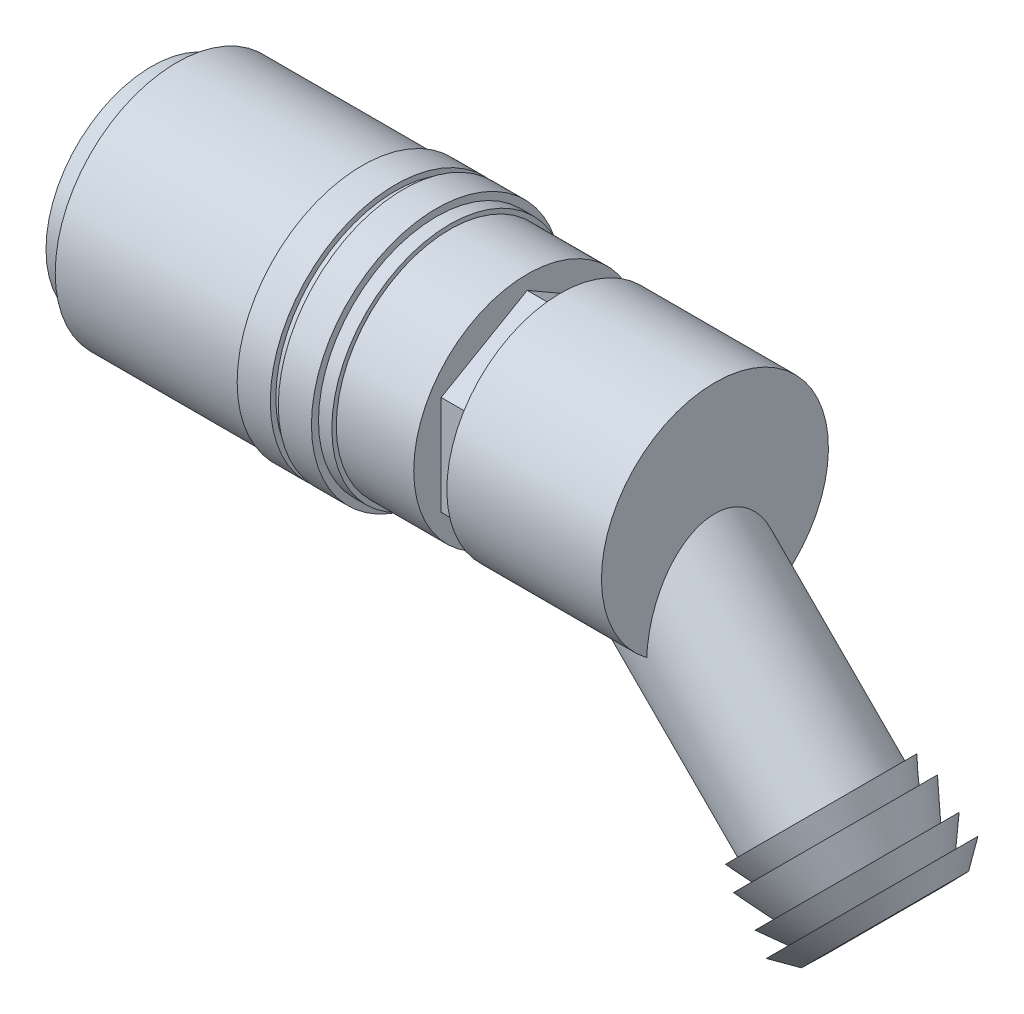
ISO-10303-21;
HEADER;
FILE_DESCRIPTION(('STEP AP214'),'2;1');
FILE_NAME('part.step','',(''),(''),'','','');
FILE_SCHEMA(('AUTOMOTIVE_DESIGN { 1 0 10303 214 1 1 1 1 }'));
ENDSEC;
DATA;
#1=APPLICATION_CONTEXT('core data for automotive mechanical design processes');
#2=APPLICATION_PROTOCOL_DEFINITION('international standard','automotive_design',2000,#1);
#3=PRODUCT_CONTEXT('',#1,'mechanical');
#4=PRODUCT('Part','Part','',(#3));
#5=PRODUCT_RELATED_PRODUCT_CATEGORY('part','',(#4));
#6=PRODUCT_DEFINITION_FORMATION('','',#4);
#7=PRODUCT_DEFINITION_CONTEXT('part definition',#1,'design');
#8=PRODUCT_DEFINITION('design','',#6,#7);
#9=PRODUCT_DEFINITION_SHAPE('','',#8);
#10=(LENGTH_UNIT() NAMED_UNIT(*) SI_UNIT(.MILLI.,.METRE.));
#11=(NAMED_UNIT(*) PLANE_ANGLE_UNIT() SI_UNIT($,.RADIAN.));
#12=(NAMED_UNIT(*) SI_UNIT($,.STERADIAN.) SOLID_ANGLE_UNIT());
#13=UNCERTAINTY_MEASURE_WITH_UNIT(LENGTH_MEASURE(1.E-05),#10,'distance_accuracy_value','');
#14=(GEOMETRIC_REPRESENTATION_CONTEXT(3) GLOBAL_UNCERTAINTY_ASSIGNED_CONTEXT((#13)) GLOBAL_UNIT_ASSIGNED_CONTEXT((#10,
#11,#12)) REPRESENTATION_CONTEXT('',''));
#15=CARTESIAN_POINT('',(0.,0.,0.));
#16=DIRECTION('',(0.,0.,1.));
#17=DIRECTION('',(1.,0.,0.));
#18=AXIS2_PLACEMENT_3D('',#15,#16,#17);
#19=CARTESIAN_POINT('',(51.,0.,0.));
#20=DIRECTION('',(-1.,0.,0.));
#21=DIRECTION('',(0.,0.,1.));
#22=AXIS2_PLACEMENT_3D('',#19,#20,#21);
#23=CYLINDRICAL_SURFACE('',#22,10.2763207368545);
#24=CARTESIAN_POINT('',(37.,0.,0.));
#25=DIRECTION('',(1.,0.,0.));
#26=DIRECTION('',(0.,0.,-1.));
#27=AXIS2_PLACEMENT_3D('',#24,#25,#26);
#28=CIRCLE('',#27,10.2763207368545);
#29=CARTESIAN_POINT('',(37.,0.,-10.2763207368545));
#30=VERTEX_POINT('',#29);
#31=EDGE_CURVE('E92',#30,#30,#28,.T.);
#32=ORIENTED_EDGE('',*,*,#31,.T.);
#33=EDGE_LOOP('',(#32));
#34=FACE_BOUND('',#33,.T.);
#35=CARTESIAN_POINT('',(51.,-8.21534723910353,6.17339757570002));
#36=CARTESIAN_POINT('',(50.8693512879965,-8.21125639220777,6.17883773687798));
#37=CARTESIAN_POINT('',(50.7385865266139,-8.20857286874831,6.18240221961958));
#38=CARTESIAN_POINT('',(50.4769371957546,-8.20624871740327,6.18548781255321));
#39=CARTESIAN_POINT('',(50.3460526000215,-8.20660919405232,6.18500745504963));
#40=CARTESIAN_POINT('',(49.9524538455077,-8.21261872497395,6.17703493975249));
#41=CARTESIAN_POINT('',(49.6898724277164,-8.22323342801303,6.16296159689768));
#42=CARTESIAN_POINT('',(49.1655951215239,-8.25948475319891,6.11429677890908));
#43=CARTESIAN_POINT('',(48.9039206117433,-8.28523334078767,6.07955234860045));
#44=CARTESIAN_POINT('',(48.3873196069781,-8.3529245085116,5.98621636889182));
#45=CARTESIAN_POINT('',(48.1323807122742,-8.39483473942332,5.92767244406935));
#46=CARTESIAN_POINT('',(47.7295574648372,-8.47538979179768,5.81148526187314));
#47=CARTESIAN_POINT('',(47.5782400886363,-8.5090813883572,5.76217027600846));
#48=CARTESIAN_POINT('',(47.2808781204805,-8.58210259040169,5.65284184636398));
#49=CARTESIAN_POINT('',(47.1348337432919,-8.62143242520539,5.59282796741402));
#50=CARTESIAN_POINT('',(46.849916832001,-8.70486442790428,5.46205824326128));
#51=CARTESIAN_POINT('',(46.7110143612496,-8.74894377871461,5.39135315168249));
#52=CARTESIAN_POINT('',(46.4407898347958,-8.84107714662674,5.23889780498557));
#53=CARTESIAN_POINT('',(46.3094676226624,-8.88913108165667,5.15714777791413));
#54=CARTESIAN_POINT('',(46.0549317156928,-8.98822340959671,4.98244136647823));
#55=CARTESIAN_POINT('',(45.9317489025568,-9.03927192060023,4.88944571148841));
#56=CARTESIAN_POINT('',(45.6948057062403,-9.14286468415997,4.69288073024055));
#57=CARTESIAN_POINT('',(45.5810455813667,-9.19540897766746,4.5893111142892));
#58=CARTESIAN_POINT('',(45.3633393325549,-9.30069155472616,4.37201337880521));
#59=CARTESIAN_POINT('',(45.2594108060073,-9.35343001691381,4.25826772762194));
#60=CARTESIAN_POINT('',(45.0619705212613,-9.45762933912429,4.02153404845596));
#61=CARTESIAN_POINT('',(44.9684587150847,-9.50909020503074,3.89854606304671));
#62=CARTESIAN_POINT('',(44.7944106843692,-9.60810034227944,3.64758608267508));
#63=CARTESIAN_POINT('',(44.7135951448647,-9.65571729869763,3.5198341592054));
#64=CARTESIAN_POINT('',(44.5620738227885,-9.747449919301,3.25719863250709));
#65=CARTESIAN_POINT('',(44.4913723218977,-9.79156409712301,3.12231204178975));
#66=CARTESIAN_POINT('',(44.3601453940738,-9.87530092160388,2.84639735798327));
#67=CARTESIAN_POINT('',(44.2996167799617,-9.914924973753,2.70537120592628));
#68=CARTESIAN_POINT('',(44.1886909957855,-9.98886898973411,2.41810977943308));
#69=CARTESIAN_POINT('',(44.1382901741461,-10.0231908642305,2.27187640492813));
#70=CARTESIAN_POINT('',(44.0451972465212,-10.0874874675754,1.967433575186));
#71=CARTESIAN_POINT('',(44.0030356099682,-10.1171474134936,1.80899515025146));
#72=CARTESIAN_POINT('',(43.9297513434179,-10.1692548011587,1.48842152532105));
#73=CARTESIAN_POINT('',(43.898629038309,-10.1917020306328,1.32628621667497));
#74=CARTESIAN_POINT('',(43.8473593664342,-10.2289328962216,0.999383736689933));
#75=CARTESIAN_POINT('',(43.8272144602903,-10.243714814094,0.834615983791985));
#76=CARTESIAN_POINT('',(43.7978690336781,-10.2653141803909,0.503592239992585));
#77=CARTESIAN_POINT('',(43.7886685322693,-10.2721316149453,0.337336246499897));
#78=CARTESIAN_POINT('',(43.7810860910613,-10.2777465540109,-0.000288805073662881));
#79=CARTESIAN_POINT('',(43.7830189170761,-10.2763107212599,-0.171668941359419));
#80=CARTESIAN_POINT('',(43.7984437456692,-10.2649025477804,-0.513625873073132));
#81=CARTESIAN_POINT('',(43.8119360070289,-10.2549300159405,-0.684202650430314));
#82=CARTESIAN_POINT('',(43.8505120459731,-10.2266543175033,-1.023361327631));
#83=CARTESIAN_POINT('',(43.8755969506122,-10.2083503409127,-1.19194303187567));
#84=CARTESIAN_POINT('',(43.9374117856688,-10.1637984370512,-1.5258917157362));
#85=CARTESIAN_POINT('',(43.9741416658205,-10.1375505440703,-1.69125870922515));
#86=CARTESIAN_POINT('',(44.0594225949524,-10.0776058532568,-2.01798967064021));
#87=CARTESIAN_POINT('',(44.108002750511,-10.0438907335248,-2.17934268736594));
#88=CARTESIAN_POINT('',(44.2170137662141,-9.96981097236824,-2.49642629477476));
#89=CARTESIAN_POINT('',(44.2774447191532,-9.92944627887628,-2.65215684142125));
#90=CARTESIAN_POINT('',(44.4102167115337,-9.84302415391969,-2.95680781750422));
#91=CARTESIAN_POINT('',(44.4825571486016,-9.79696701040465,-3.10572859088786));
#92=CARTESIAN_POINT('',(44.6391691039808,-9.70030584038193,-3.39561149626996));
#93=CARTESIAN_POINT('',(44.7234403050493,-9.64970193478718,-3.53657383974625));
#94=CARTESIAN_POINT('',(44.901845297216,-9.5464379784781,-3.80640200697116));
#95=CARTESIAN_POINT('',(44.9957188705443,-9.49384843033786,-3.93546678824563));
#96=CARTESIAN_POINT('',(45.1946191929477,-9.38699082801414,-4.18395316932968));
#97=CARTESIAN_POINT('',(45.299645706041,-9.33272280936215,-4.30337497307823));
#98=CARTESIAN_POINT('',(45.5203960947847,-9.22405096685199,-4.5316246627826));
#99=CARTESIAN_POINT('',(45.6361116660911,-9.16964727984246,-4.64046064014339));
#100=CARTESIAN_POINT('',(45.8777099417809,-9.0622010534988,-4.84694036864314));
#101=CARTESIAN_POINT('',(46.0035921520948,-9.00915844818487,-4.94458466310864));
#102=CARTESIAN_POINT('',(46.2578493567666,-8.90861591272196,-5.12340733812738));
#103=CARTESIAN_POINT('',(46.3857501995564,-8.8609711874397,-5.20517958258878));
#104=CARTESIAN_POINT('',(46.6490056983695,-8.7693675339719,-5.35806935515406));
#105=CARTESIAN_POINT('',(46.7843599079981,-8.72540838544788,-5.42918752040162));
#106=CARTESIAN_POINT('',(47.0615048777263,-8.64209548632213,-5.56084800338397));
#107=CARTESIAN_POINT('',(47.2032970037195,-8.60274271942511,-5.62138806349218));
#108=CARTESIAN_POINT('',(47.4921826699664,-8.52932375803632,-5.73217392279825));
#109=CARTESIAN_POINT('',(47.6392772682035,-8.49525862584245,-5.78241765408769));
#110=CARTESIAN_POINT('',(47.9788779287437,-8.42421121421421,-5.88560944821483));
#111=CARTESIAN_POINT('',(48.1727019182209,-8.38902343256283,-5.93546915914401));
#112=CARTESIAN_POINT('',(48.5650261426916,-8.32821805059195,-6.02048788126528));
#113=CARTESIAN_POINT('',(48.7635280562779,-8.30260394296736,-6.05564152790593));
#114=CARTESIAN_POINT('',(49.1636795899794,-8.26065550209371,-6.1127399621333));
#115=CARTESIAN_POINT('',(49.3653338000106,-8.24433631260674,-6.13466319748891));
#116=CARTESIAN_POINT('',(49.7700043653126,-8.22043913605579,-6.16664734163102));
#117=CARTESIAN_POINT('',(49.9730203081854,-8.21285861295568,-6.17671169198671));
#118=CARTESIAN_POINT('',(50.313796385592,-8.2068074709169,-6.18474645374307));
#119=CARTESIAN_POINT('',(50.4514690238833,-8.20618620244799,-6.18557190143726));
#120=CARTESIAN_POINT('',(50.7261416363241,-8.20832019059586,-6.18273645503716));
#121=CARTESIAN_POINT('',(50.8631419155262,-8.21106066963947,-6.17909519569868));
#122=CARTESIAN_POINT('',(51.,-8.21534723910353,-6.17339757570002));
#123=B_SPLINE_CURVE_WITH_KNOTS('',3,(#35,#36,#37,#38,#39,#40,#41,#42,#43,#44,#45,#46,#47,#48,
#49,#50,#51,#52,#53,#54,#55,#56,#57,#58,#59,#60,#61,#62,#63,#64,#65,#66,#67,#68,#69,#70,#71,#72,
#73,#74,#75,#76,#77,#78,#79,#80,#81,#82,#83,#84,#85,#86,#87,#88,#89,#90,#91,#92,#93,#94,#95,#96,
#97,#98,#99,#100,#101,#102,#103,#104,#105,#106,#107,#108,#109,#110,#111,#112,#113,#114,#115,
#116,#117,#118,#119,#120,#121,#122),.UNSPECIFIED.,.F.,.F.,(4,2,2,2,2,2,2,2,2,2,2,2,2,2,2,2,2,2,
2,2,2,2,2,2,2,2,2,2,2,2,2,2,2,2,2,2,2,2,2,2,2,2,2,4),(0.,0.392436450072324,0.785015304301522,
1.57340227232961,2.3676967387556,3.16040952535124,3.64797534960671,4.13556100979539,
4.62090072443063,5.10623041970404,5.59330671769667,6.08039636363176,6.56834196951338,
7.05628532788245,7.53122927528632,8.00637369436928,8.48136897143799,8.95619268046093,
9.45546226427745,9.95474654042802,10.4541426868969,10.9535397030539,11.4671239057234,
11.980719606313,12.4943652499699,13.0080086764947,13.5229266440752,14.0378486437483,
14.5527446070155,15.0676268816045,15.5710887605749,16.0745399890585,16.5776033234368,
17.0806422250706,17.5573897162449,18.0341086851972,18.5109292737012,18.9878455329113,
19.5965312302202,20.2054387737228,20.8153355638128,21.4250553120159,21.8379775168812,
22.2490910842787),.UNSPECIFIED.);
#124=CARTESIAN_POINT('',(51.,-8.21534723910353,6.17339757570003));
#125=VERTEX_POINT('',#124);
#126=CARTESIAN_POINT('',(51.,-8.21534723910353,-6.17339757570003));
#127=VERTEX_POINT('',#126);
#128=EDGE_CURVE('E81',#125,#127,#123,.T.);
#129=ORIENTED_EDGE('',*,*,#128,.F.);
#130=CARTESIAN_POINT('',(51.,0.,0.));
#131=DIRECTION('',(1.,0.,0.));
#132=DIRECTION('',(0.,0.,-1.));
#133=AXIS2_PLACEMENT_3D('',#130,#131,#132);
#134=CIRCLE('',#133,10.2763207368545);
#135=EDGE_CURVE('E87',#127,#125,#134,.T.);
#136=ORIENTED_EDGE('',*,*,#135,.F.);
#137=EDGE_LOOP('',(#129,#136));
#138=FACE_BOUND('',#137,.T.);
#139=ADVANCED_FACE('F16',(#34,#138),#23,.T.);
#140=CARTESIAN_POINT('',(34.,6.8,0.));
#141=DIRECTION('',(-1.,0.,0.));
#142=DIRECTION('',(0.,0.,1.));
#143=AXIS2_PLACEMENT_3D('',#140,#141,#142);
#144=PLANE('',#143);
#145=CARTESIAN_POINT('',(34.,0.,0.));
#146=DIRECTION('',(-1.,0.,0.));
#147=DIRECTION('',(0.,0.,1.));
#148=AXIS2_PLACEMENT_3D('',#145,#146,#147);
#149=CIRCLE('',#148,10.2763207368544);
#150=CARTESIAN_POINT('',(34.,0.,10.2763207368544));
#151=VERTEX_POINT('',#150);
#152=EDGE_CURVE('E198',#151,#151,#149,.T.);
#153=ORIENTED_EDGE('',*,*,#152,.F.);
#154=EDGE_LOOP('',(#153));
#155=FACE_BOUND('',#154,.T.);
#156=DIRECTION('',(0.,0.5,0.866025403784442));
#157=VECTOR('',#156,1.);
#158=CARTESIAN_POINT('',(34.,4.50000000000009,-7.7942286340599));
#159=LINE('',#158,#157);
#160=CARTESIAN_POINT('',(34.,4.50000000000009,-7.7942286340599));
#161=VERTEX_POINT('',#160);
#162=CARTESIAN_POINT('',(34.,9.,0.));
#163=VERTEX_POINT('',#162);
#164=EDGE_CURVE('E111',#161,#163,#159,.T.);
#165=ORIENTED_EDGE('',*,*,#164,.F.);
#166=DIRECTION('',(0.,1.,0.));
#167=VECTOR('',#166,1.);
#168=CARTESIAN_POINT('',(34.,-4.49999999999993,-7.79422863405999));
#169=LINE('',#168,#167);
#170=CARTESIAN_POINT('',(34.,-4.49999999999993,-7.79422863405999));
#171=VERTEX_POINT('',#170);
#172=EDGE_CURVE('E116',#171,#161,#169,.T.);
#173=ORIENTED_EDGE('',*,*,#172,.F.);
#174=DIRECTION('',(0.,0.500000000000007,-0.866025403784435));
#175=VECTOR('',#174,1.);
#176=CARTESIAN_POINT('',(34.,-9.,0.));
#177=LINE('',#176,#175);
#178=CARTESIAN_POINT('',(34.,-9.,0.));
#179=VERTEX_POINT('',#178);
#180=EDGE_CURVE('E141',#179,#171,#177,.T.);
#181=ORIENTED_EDGE('',*,*,#180,.F.);
#182=DIRECTION('',(0.,-0.5,-0.866025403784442));
#183=VECTOR('',#182,1.);
#184=CARTESIAN_POINT('',(34.,-4.5,7.79422863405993));
#185=LINE('',#184,#183);
#186=CARTESIAN_POINT('',(34.,-4.5,7.79422863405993));
#187=VERTEX_POINT('',#186);
#188=EDGE_CURVE('E138',#187,#179,#185,.T.);
#189=ORIENTED_EDGE('',*,*,#188,.F.);
#190=DIRECTION('',(0.,-1.,0.));
#191=VECTOR('',#190,1.);
#192=CARTESIAN_POINT('',(34.,4.5,7.79422863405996));
#193=LINE('',#192,#191);
#194=CARTESIAN_POINT('',(34.,4.5,7.79422863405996));
#195=VERTEX_POINT('',#194);
#196=EDGE_CURVE('E135',#195,#187,#193,.T.);
#197=ORIENTED_EDGE('',*,*,#196,.F.);
#198=DIRECTION('',(0.,-0.5,0.866025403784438));
#199=VECTOR('',#198,1.);
#200=CARTESIAN_POINT('',(34.,9.,0.));
#201=LINE('',#200,#199);
#202=EDGE_CURVE('E37',#163,#195,#201,.T.);
#203=ORIENTED_EDGE('',*,*,#202,.F.);
#204=EDGE_LOOP('',(#165,#173,#181,#189,#197,#203));
#205=FACE_BOUND('',#204,.T.);
#206=ADVANCED_FACE('F214',(#155,#205),#144,.F.);
#207=CARTESIAN_POINT('',(0.,0.,0.));
#208=DIRECTION('',(-1.,0.,0.));
#209=DIRECTION('',(0.,0.,1.));
#210=AXIS2_PLACEMENT_3D('',#207,#208,#209);
#211=CYLINDRICAL_SURFACE('',#210,9.57299306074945);
#212=CARTESIAN_POINT('',(0.,0.,0.));
#213=DIRECTION('',(-1.,0.,0.));
#214=DIRECTION('',(0.,0.,1.));
#215=AXIS2_PLACEMENT_3D('',#212,#213,#214);
#216=CIRCLE('',#215,9.57299306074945);
#217=CARTESIAN_POINT('',(0.,0.,9.57299306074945));
#218=VERTEX_POINT('',#217);
#219=EDGE_CURVE('E85',#218,#218,#216,.T.);
#220=ORIENTED_EDGE('',*,*,#219,.F.);
#221=EDGE_LOOP('',(#220));
#222=FACE_BOUND('',#221,.T.);
#223=CARTESIAN_POINT('',(2.26082941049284,0.,0.));
#224=DIRECTION('',(-1.,0.,0.));
#225=DIRECTION('',(0.,0.,1.));
#226=AXIS2_PLACEMENT_3D('',#223,#224,#225);
#227=CIRCLE('',#226,9.57299306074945);
#228=CARTESIAN_POINT('',(2.26082941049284,0.,9.57299306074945));
#229=VERTEX_POINT('',#228);
#230=EDGE_CURVE('E162',#229,#229,#227,.T.);
#231=ORIENTED_EDGE('',*,*,#230,.T.);
#232=EDGE_LOOP('',(#231));
#233=FACE_BOUND('',#232,.T.);
#234=ADVANCED_FACE('F18',(#222,#233),#211,.T.);
#235=CARTESIAN_POINT('',(0.,6.8,0.));
#236=DIRECTION('',(1.,0.,0.));
#237=DIRECTION('',(0.,0.,-1.));
#238=AXIS2_PLACEMENT_3D('',#235,#236,#237);
#239=PLANE('',#238);
#240=CARTESIAN_POINT('',(0.,0.,0.));
#241=DIRECTION('',(-1.,0.,0.));
#242=DIRECTION('',(0.,0.,1.));
#243=AXIS2_PLACEMENT_3D('',#240,#241,#242);
#244=CIRCLE('',#243,6.8);
#245=CARTESIAN_POINT('',(0.,0.,6.8));
#246=VERTEX_POINT('',#245);
#247=EDGE_CURVE('E204',#246,#246,#244,.T.);
#248=ORIENTED_EDGE('',*,*,#247,.F.);
#249=EDGE_LOOP('',(#248));
#250=FACE_BOUND('',#249,.T.);
#251=ORIENTED_EDGE('',*,*,#219,.T.);
#252=EDGE_LOOP('',(#251));
#253=FACE_BOUND('',#252,.T.);
#254=ADVANCED_FACE('F210',(#250,#253),#239,.F.);
#255=CARTESIAN_POINT('',(0.,0.,0.));
#256=DIRECTION('',(-1.,0.,0.));
#257=DIRECTION('',(0.,0.,1.));
#258=AXIS2_PLACEMENT_3D('',#255,#256,#257);
#259=CYLINDRICAL_SURFACE('',#258,6.8);
#260=CARTESIAN_POINT('',(34.,0.,0.));
#261=DIRECTION('',(-1.,0.,0.));
#262=DIRECTION('',(0.,0.,1.));
#263=AXIS2_PLACEMENT_3D('',#260,#261,#262);
#264=CIRCLE('',#263,6.8);
#265=CARTESIAN_POINT('',(34.,0.,6.8));
#266=VERTEX_POINT('',#265);
#267=EDGE_CURVE('E201',#266,#266,#264,.T.);
#268=ORIENTED_EDGE('',*,*,#267,.F.);
#269=EDGE_LOOP('',(#268));
#270=FACE_BOUND('',#269,.T.);
#271=ORIENTED_EDGE('',*,*,#247,.T.);
#272=EDGE_LOOP('',(#271));
#273=FACE_BOUND('',#272,.T.);
#274=ADVANCED_FACE('F287',(#270,#273),#259,.F.);
#275=CARTESIAN_POINT('',(0.,0.,0.));
#276=DIRECTION('',(-1.,0.,0.));
#277=DIRECTION('',(0.,0.,1.));
#278=AXIS2_PLACEMENT_3D('',#275,#276,#277);
#279=CYLINDRICAL_SURFACE('',#278,10.2763207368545);
#280=CARTESIAN_POINT('',(26.9893792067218,0.,0.));
#281=DIRECTION('',(-1.,0.,0.));
#282=DIRECTION('',(0.,0.,1.));
#283=AXIS2_PLACEMENT_3D('',#280,#281,#282);
#284=CIRCLE('',#283,10.2763207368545);
#285=CARTESIAN_POINT('',(26.9893792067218,0.,10.2763207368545));
#286=VERTEX_POINT('',#285);
#287=EDGE_CURVE('E195',#286,#286,#284,.T.);
#288=ORIENTED_EDGE('',*,*,#287,.F.);
#289=EDGE_LOOP('',(#288));
#290=FACE_BOUND('',#289,.T.);
#291=ORIENTED_EDGE('',*,*,#152,.T.);
#292=EDGE_LOOP('',(#291));
#293=FACE_BOUND('',#292,.T.);
#294=ADVANCED_FACE('F281',(#290,#293),#279,.T.);
#295=CARTESIAN_POINT('',(26.9893792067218,10.6817722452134,0.));
#296=DIRECTION('',(-1.,0.,0.));
#297=DIRECTION('',(0.,0.,1.));
#298=AXIS2_PLACEMENT_3D('',#295,#296,#297);
#299=PLANE('',#298);
#300=CARTESIAN_POINT('',(26.9893792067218,0.,0.));
#301=DIRECTION('',(-1.,0.,0.));
#302=DIRECTION('',(0.,0.,1.));
#303=AXIS2_PLACEMENT_3D('',#300,#301,#302);
#304=CIRCLE('',#303,10.6817722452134);
#305=CARTESIAN_POINT('',(26.9893792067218,0.,10.6817722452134));
#306=VERTEX_POINT('',#305);
#307=EDGE_CURVE('E192',#306,#306,#304,.T.);
#308=ORIENTED_EDGE('',*,*,#307,.F.);
#309=EDGE_LOOP('',(#308));
#310=FACE_BOUND('',#309,.T.);
#311=ORIENTED_EDGE('',*,*,#287,.T.);
#312=EDGE_LOOP('',(#311));
#313=FACE_BOUND('',#312,.T.);
#314=ADVANCED_FACE('F275',(#310,#313),#299,.F.);
#315=CARTESIAN_POINT('',(0.,0.,0.));
#316=DIRECTION('',(-1.,0.,0.));
#317=DIRECTION('',(0.,0.,1.));
#318=AXIS2_PLACEMENT_3D('',#315,#316,#317);
#319=CYLINDRICAL_SURFACE('',#318,10.6817722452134);
#320=CARTESIAN_POINT('',(25.7841800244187,0.,0.));
#321=DIRECTION('',(-1.,0.,0.));
#322=DIRECTION('',(0.,0.,1.));
#323=AXIS2_PLACEMENT_3D('',#320,#321,#322);
#324=CIRCLE('',#323,10.6817722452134);
#325=CARTESIAN_POINT('',(25.7841800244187,0.,10.6817722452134));
#326=VERTEX_POINT('',#325);
#327=EDGE_CURVE('E189',#326,#326,#324,.T.);
#328=ORIENTED_EDGE('',*,*,#327,.F.);
#329=EDGE_LOOP('',(#328));
#330=FACE_BOUND('',#329,.T.);
#331=ORIENTED_EDGE('',*,*,#307,.T.);
#332=EDGE_LOOP('',(#331));
#333=FACE_BOUND('',#332,.T.);
#334=ADVANCED_FACE('F269',(#330,#333),#319,.T.);
#335=CARTESIAN_POINT('',(25.7841800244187,11.3216876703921,0.));
#336=DIRECTION('',(-1.,0.,0.));
#337=DIRECTION('',(0.,0.,1.));
#338=AXIS2_PLACEMENT_3D('',#335,#336,#337);
#339=PLANE('',#338);
#340=CARTESIAN_POINT('',(25.7841800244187,0.,0.));
#341=DIRECTION('',(-1.,0.,0.));
#342=DIRECTION('',(0.,0.,1.));
#343=AXIS2_PLACEMENT_3D('',#340,#341,#342);
#344=CIRCLE('',#343,11.3216876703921);
#345=CARTESIAN_POINT('',(25.7841800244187,0.,11.3216876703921));
#346=VERTEX_POINT('',#345);
#347=EDGE_CURVE('E186',#346,#346,#344,.T.);
#348=ORIENTED_EDGE('',*,*,#347,.F.);
#349=EDGE_LOOP('',(#348));
#350=FACE_BOUND('',#349,.T.);
#351=ORIENTED_EDGE('',*,*,#327,.T.);
#352=EDGE_LOOP('',(#351));
#353=FACE_BOUND('',#352,.T.);
#354=ADVANCED_FACE('F263',(#350,#353),#339,.F.);
#355=CARTESIAN_POINT('',(0.,0.,0.));
#356=DIRECTION('',(-1.,0.,0.));
#357=DIRECTION('',(0.,0.,1.));
#358=AXIS2_PLACEMENT_3D('',#355,#356,#357);
#359=CYLINDRICAL_SURFACE('',#358,11.3216876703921);
#360=CARTESIAN_POINT('',(22.7841800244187,0.,0.));
#361=DIRECTION('',(-1.,0.,0.));
#362=DIRECTION('',(0.,0.,1.));
#363=AXIS2_PLACEMENT_3D('',#360,#361,#362);
#364=CIRCLE('',#363,11.3216876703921);
#365=CARTESIAN_POINT('',(22.7841800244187,0.,11.3216876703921));
#366=VERTEX_POINT('',#365);
#367=EDGE_CURVE('E183',#366,#366,#364,.T.);
#368=ORIENTED_EDGE('',*,*,#367,.F.);
#369=EDGE_LOOP('',(#368));
#370=FACE_BOUND('',#369,.T.);
#371=ORIENTED_EDGE('',*,*,#347,.T.);
#372=EDGE_LOOP('',(#371));
#373=FACE_BOUND('',#372,.T.);
#374=ADVANCED_FACE('F257',(#370,#373),#359,.T.);
#375=CARTESIAN_POINT('',(22.7841800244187,10.8216876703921,0.));
#376=DIRECTION('',(1.,0.,0.));
#377=DIRECTION('',(0.,0.,-1.));
#378=AXIS2_PLACEMENT_3D('',#375,#376,#377);
#379=PLANE('',#378);
#380=CARTESIAN_POINT('',(22.7841800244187,0.,0.));
#381=DIRECTION('',(-1.,0.,0.));
#382=DIRECTION('',(0.,0.,1.));
#383=AXIS2_PLACEMENT_3D('',#380,#381,#382);
#384=CIRCLE('',#383,10.8216876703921);
#385=CARTESIAN_POINT('',(22.7841800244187,0.,10.8216876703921));
#386=VERTEX_POINT('',#385);
#387=EDGE_CURVE('E180',#386,#386,#384,.T.);
#388=ORIENTED_EDGE('',*,*,#387,.F.);
#389=EDGE_LOOP('',(#388));
#390=FACE_BOUND('',#389,.T.);
#391=ORIENTED_EDGE('',*,*,#367,.T.);
#392=EDGE_LOOP('',(#391));
#393=FACE_BOUND('',#392,.T.);
#394=ADVANCED_FACE('F251',(#390,#393),#379,.F.);
#395=CARTESIAN_POINT('',(0.,0.,0.));
#396=DIRECTION('',(-1.,0.,0.));
#397=DIRECTION('',(0.,0.,1.));
#398=AXIS2_PLACEMENT_3D('',#395,#396,#397);
#399=CYLINDRICAL_SURFACE('',#398,10.8216876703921);
#400=CARTESIAN_POINT('',(22.0582244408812,0.,0.));
#401=DIRECTION('',(-1.,0.,0.));
#402=DIRECTION('',(0.,0.,1.));
#403=AXIS2_PLACEMENT_3D('',#400,#401,#402);
#404=CIRCLE('',#403,10.8216876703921);
#405=CARTESIAN_POINT('',(22.0582244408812,0.,10.8216876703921));
#406=VERTEX_POINT('',#405);
#407=EDGE_CURVE('E177',#406,#406,#404,.T.);
#408=ORIENTED_EDGE('',*,*,#407,.F.);
#409=EDGE_LOOP('',(#408));
#410=FACE_BOUND('',#409,.T.);
#411=ORIENTED_EDGE('',*,*,#387,.T.);
#412=EDGE_LOOP('',(#411));
#413=FACE_BOUND('',#412,.T.);
#414=ADVANCED_FACE('F245',(#410,#413),#399,.T.);
#415=CARTESIAN_POINT('',(22.0582244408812,11.3216876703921,0.));
#416=DIRECTION('',(-1.,0.,0.));
#417=DIRECTION('',(0.,0.,1.));
#418=AXIS2_PLACEMENT_3D('',#415,#416,#417);
#419=PLANE('',#418);
#420=CARTESIAN_POINT('',(22.0582244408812,0.,0.));
#421=DIRECTION('',(-1.,0.,0.));
#422=DIRECTION('',(0.,0.,1.));
#423=AXIS2_PLACEMENT_3D('',#420,#421,#422);
#424=CIRCLE('',#423,11.3216876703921);
#425=CARTESIAN_POINT('',(22.0582244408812,0.,11.3216876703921));
#426=VERTEX_POINT('',#425);
#427=EDGE_CURVE('E174',#426,#426,#424,.T.);
#428=ORIENTED_EDGE('',*,*,#427,.F.);
#429=EDGE_LOOP('',(#428));
#430=FACE_BOUND('',#429,.T.);
#431=ORIENTED_EDGE('',*,*,#407,.T.);
#432=EDGE_LOOP('',(#431));
#433=FACE_BOUND('',#432,.T.);
#434=ADVANCED_FACE('F239',(#430,#433),#419,.F.);
#435=CARTESIAN_POINT('',(0.,0.,0.));
#436=DIRECTION('',(-1.,0.,0.));
#437=DIRECTION('',(0.,0.,1.));
#438=AXIS2_PLACEMENT_3D('',#435,#436,#437);
#439=CYLINDRICAL_SURFACE('',#438,11.3216876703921);
#440=CARTESIAN_POINT('',(19.0582244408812,0.,0.));
#441=DIRECTION('',(-1.,0.,0.));
#442=DIRECTION('',(0.,0.,1.));
#443=AXIS2_PLACEMENT_3D('',#440,#441,#442);
#444=CIRCLE('',#443,11.3216876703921);
#445=CARTESIAN_POINT('',(19.0582244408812,0.,11.3216876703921));
#446=VERTEX_POINT('',#445);
#447=EDGE_CURVE('E171',#446,#446,#444,.T.);
#448=ORIENTED_EDGE('',*,*,#447,.F.);
#449=EDGE_LOOP('',(#448));
#450=FACE_BOUND('',#449,.T.);
#451=ORIENTED_EDGE('',*,*,#427,.T.);
#452=EDGE_LOOP('',(#451));
#453=FACE_BOUND('',#452,.T.);
#454=ADVANCED_FACE('F233',(#450,#453),#439,.T.);
#455=CARTESIAN_POINT('',(19.0582244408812,11.,0.));
#456=DIRECTION('',(1.,0.,0.));
#457=DIRECTION('',(0.,0.,-1.));
#458=AXIS2_PLACEMENT_3D('',#455,#456,#457);
#459=PLANE('',#458);
#460=CARTESIAN_POINT('',(19.0582244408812,0.,0.));
#461=DIRECTION('',(-1.,0.,0.));
#462=DIRECTION('',(0.,0.,1.));
#463=AXIS2_PLACEMENT_3D('',#460,#461,#462);
#464=CIRCLE('',#463,11.);
#465=CARTESIAN_POINT('',(19.0582244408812,0.,11.));
#466=VERTEX_POINT('',#465);
#467=EDGE_CURVE('E168',#466,#466,#464,.T.);
#468=ORIENTED_EDGE('',*,*,#467,.F.);
#469=EDGE_LOOP('',(#468));
#470=FACE_BOUND('',#469,.T.);
#471=ORIENTED_EDGE('',*,*,#447,.T.);
#472=EDGE_LOOP('',(#471));
#473=FACE_BOUND('',#472,.T.);
#474=ADVANCED_FACE('F227',(#470,#473),#459,.F.);
#475=CARTESIAN_POINT('',(0.,0.,0.));
#476=DIRECTION('',(-1.,0.,0.));
#477=DIRECTION('',(0.,0.,1.));
#478=AXIS2_PLACEMENT_3D('',#475,#476,#477);
#479=CYLINDRICAL_SURFACE('',#478,11.);
#480=CARTESIAN_POINT('',(2.26082941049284,0.,0.));
#481=DIRECTION('',(-1.,0.,0.));
#482=DIRECTION('',(0.,0.,1.));
#483=AXIS2_PLACEMENT_3D('',#480,#481,#482);
#484=CIRCLE('',#483,11.);
#485=CARTESIAN_POINT('',(2.26082941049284,0.,11.));
#486=VERTEX_POINT('',#485);
#487=EDGE_CURVE('E165',#486,#486,#484,.T.);
#488=ORIENTED_EDGE('',*,*,#487,.F.);
#489=EDGE_LOOP('',(#488));
#490=FACE_BOUND('',#489,.T.);
#491=ORIENTED_EDGE('',*,*,#467,.T.);
#492=EDGE_LOOP('',(#491));
#493=FACE_BOUND('',#492,.T.);
#494=ADVANCED_FACE('F221',(#490,#493),#479,.T.);
#495=CARTESIAN_POINT('',(2.26082941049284,9.57299306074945,0.));
#496=DIRECTION('',(1.,0.,0.));
#497=DIRECTION('',(0.,0.,-1.));
#498=AXIS2_PLACEMENT_3D('',#495,#496,#497);
#499=PLANE('',#498);
#500=ORIENTED_EDGE('',*,*,#230,.F.);
#501=EDGE_LOOP('',(#500));
#502=FACE_BOUND('',#501,.T.);
#503=ORIENTED_EDGE('',*,*,#487,.T.);
#504=EDGE_LOOP('',(#503));
#505=FACE_BOUND('',#504,.T.);
#506=ADVANCED_FACE('F217',(#502,#505),#499,.F.);
#507=CARTESIAN_POINT('',(34.,0.,0.));
#508=DIRECTION('',(1.,0.,0.));
#509=DIRECTION('',(0.,0.,-1.));
#510=AXIS2_PLACEMENT_3D('',#507,#508,#509);
#511=PLANE('',#510);
#512=CARTESIAN_POINT('',(34.,0.,0.));
#513=DIRECTION('',(1.,0.,0.));
#514=DIRECTION('',(0.,0.,-1.));
#515=AXIS2_PLACEMENT_3D('',#512,#513,#514);
#516=CIRCLE('',#515,4.75);
#517=CARTESIAN_POINT('',(34.,0.,-4.75));
#518=VERTEX_POINT('',#517);
#519=EDGE_CURVE('E108',#518,#518,#516,.T.);
#520=ORIENTED_EDGE('',*,*,#519,.T.);
#521=EDGE_LOOP('',(#520));
#522=FACE_BOUND('',#521,.T.);
#523=ORIENTED_EDGE('',*,*,#267,.T.);
#524=EDGE_LOOP('',(#523));
#525=FACE_BOUND('',#524,.T.);
#526=ADVANCED_FACE('F220',(#522,#525),#511,.F.);
#527=CARTESIAN_POINT('',(37.,4.50000000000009,-7.7942286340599));
#528=DIRECTION('',(0.,-0.866025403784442,0.5));
#529=DIRECTION('',(0.,-0.5,-0.866025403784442));
#530=AXIS2_PLACEMENT_3D('',#527,#528,#529);
#531=PLANE('',#530);
#532=ORIENTED_EDGE('',*,*,#164,.T.);
#533=DIRECTION('',(-1.,0.,0.));
#534=VECTOR('',#533,1.);
#535=CARTESIAN_POINT('',(37.,9.,0.));
#536=LINE('',#535,#534);
#537=CARTESIAN_POINT('',(37.,9.,0.));
#538=VERTEX_POINT('',#537);
#539=EDGE_CURVE('E160',#538,#163,#536,.T.);
#540=ORIENTED_EDGE('',*,*,#539,.F.);
#541=DIRECTION('',(0.,0.5,0.866025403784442));
#542=VECTOR('',#541,1.);
#543=CARTESIAN_POINT('',(37.,4.50000000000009,-7.7942286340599));
#544=LINE('',#543,#542);
#545=CARTESIAN_POINT('',(37.,4.50000000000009,-7.7942286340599));
#546=VERTEX_POINT('',#545);
#547=EDGE_CURVE('E112',#546,#538,#544,.T.);
#548=ORIENTED_EDGE('',*,*,#547,.F.);
#549=DIRECTION('',(-1.,0.,0.));
#550=VECTOR('',#549,1.);
#551=CARTESIAN_POINT('',(37.,4.50000000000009,-7.7942286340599));
#552=LINE('',#551,#550);
#553=EDGE_CURVE('E131',#546,#161,#552,.T.);
#554=ORIENTED_EDGE('',*,*,#553,.T.);
#555=EDGE_LOOP('',(#532,#540,#548,#554));
#556=FACE_BOUND('',#555,.T.);
#557=ADVANCED_FACE('F299',(#556),#531,.F.);
#558=CARTESIAN_POINT('',(37.,9.,0.));
#559=DIRECTION('',(0.,-0.866025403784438,-0.5));
#560=DIRECTION('',(0.,0.5,-0.866025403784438));
#561=AXIS2_PLACEMENT_3D('',#558,#559,#560);
#562=PLANE('',#561);
#563=ORIENTED_EDGE('',*,*,#202,.T.);
#564=DIRECTION('',(-1.,0.,0.));
#565=VECTOR('',#564,1.);
#566=CARTESIAN_POINT('',(37.,4.5,7.79422863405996));
#567=LINE('',#566,#565);
#568=CARTESIAN_POINT('',(37.,4.5,7.79422863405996));
#569=VERTEX_POINT('',#568);
#570=EDGE_CURVE('E157',#569,#195,#567,.T.);
#571=ORIENTED_EDGE('',*,*,#570,.F.);
#572=DIRECTION('',(0.,-0.5,0.866025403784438));
#573=VECTOR('',#572,1.);
#574=CARTESIAN_POINT('',(37.,9.,0.));
#575=LINE('',#574,#573);
#576=EDGE_CURVE('E115',#538,#569,#575,.T.);
#577=ORIENTED_EDGE('',*,*,#576,.F.);
#578=ORIENTED_EDGE('',*,*,#539,.T.);
#579=EDGE_LOOP('',(#563,#571,#577,#578));
#580=FACE_BOUND('',#579,.T.);
#581=ADVANCED_FACE('F313',(#580),#562,.F.);
#582=CARTESIAN_POINT('',(37.,4.5,7.79422863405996));
#583=DIRECTION('',(0.,0.,-1.));
#584=DIRECTION('',(0.,1.,0.));
#585=AXIS2_PLACEMENT_3D('',#582,#583,#584);
#586=PLANE('',#585);
#587=ORIENTED_EDGE('',*,*,#196,.T.);
#588=DIRECTION('',(-1.,0.,0.));
#589=VECTOR('',#588,1.);
#590=CARTESIAN_POINT('',(37.,-4.5,7.79422863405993));
#591=LINE('',#590,#589);
#592=CARTESIAN_POINT('',(37.,-4.5,7.79422863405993));
#593=VERTEX_POINT('',#592);
#594=EDGE_CURVE('E154',#593,#187,#591,.T.);
#595=ORIENTED_EDGE('',*,*,#594,.F.);
#596=DIRECTION('',(0.,-1.,0.));
#597=VECTOR('',#596,1.);
#598=CARTESIAN_POINT('',(37.,4.5,7.79422863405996));
#599=LINE('',#598,#597);
#600=EDGE_CURVE('E119',#569,#593,#599,.T.);
#601=ORIENTED_EDGE('',*,*,#600,.F.);
#602=ORIENTED_EDGE('',*,*,#570,.T.);
#603=EDGE_LOOP('',(#587,#595,#601,#602));
#604=FACE_BOUND('',#603,.T.);
#605=ADVANCED_FACE('F311',(#604),#586,.F.);
#606=CARTESIAN_POINT('',(37.,-4.5,7.79422863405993));
#607=DIRECTION('',(0.,0.866025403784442,-0.5));
#608=DIRECTION('',(0.,0.5,0.866025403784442));
#609=AXIS2_PLACEMENT_3D('',#606,#607,#608);
#610=PLANE('',#609);
#611=ORIENTED_EDGE('',*,*,#188,.T.);
#612=DIRECTION('',(-1.,0.,0.));
#613=VECTOR('',#612,1.);
#614=CARTESIAN_POINT('',(37.,-9.,0.));
#615=LINE('',#614,#613);
#616=CARTESIAN_POINT('',(37.,-9.,0.));
#617=VERTEX_POINT('',#616);
#618=EDGE_CURVE('E151',#617,#179,#615,.T.);
#619=ORIENTED_EDGE('',*,*,#618,.F.);
#620=DIRECTION('',(0.,-0.5,-0.866025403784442));
#621=VECTOR('',#620,1.);
#622=CARTESIAN_POINT('',(37.,-4.5,7.79422863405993));
#623=LINE('',#622,#621);
#624=EDGE_CURVE('E122',#593,#617,#623,.T.);
#625=ORIENTED_EDGE('',*,*,#624,.F.);
#626=ORIENTED_EDGE('',*,*,#594,.T.);
#627=EDGE_LOOP('',(#611,#619,#625,#626));
#628=FACE_BOUND('',#627,.T.);
#629=ADVANCED_FACE('F308',(#628),#610,.F.);
#630=CARTESIAN_POINT('',(37.,-9.,0.));
#631=DIRECTION('',(0.,0.866025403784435,0.500000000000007));
#632=DIRECTION('',(0.,-0.500000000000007,0.866025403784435));
#633=AXIS2_PLACEMENT_3D('',#630,#631,#632);
#634=PLANE('',#633);
#635=ORIENTED_EDGE('',*,*,#180,.T.);
#636=DIRECTION('',(-1.,0.,0.));
#637=VECTOR('',#636,1.);
#638=CARTESIAN_POINT('',(37.,-4.49999999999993,-7.79422863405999));
#639=LINE('',#638,#637);
#640=CARTESIAN_POINT('',(37.,-4.49999999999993,-7.79422863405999));
#641=VERTEX_POINT('',#640);
#642=EDGE_CURVE('E148',#641,#171,#639,.T.);
#643=ORIENTED_EDGE('',*,*,#642,.F.);
#644=DIRECTION('',(0.,0.500000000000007,-0.866025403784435));
#645=VECTOR('',#644,1.);
#646=CARTESIAN_POINT('',(37.,-9.,0.));
#647=LINE('',#646,#645);
#648=EDGE_CURVE('E125',#617,#641,#647,.T.);
#649=ORIENTED_EDGE('',*,*,#648,.F.);
#650=ORIENTED_EDGE('',*,*,#618,.T.);
#651=EDGE_LOOP('',(#635,#643,#649,#650));
#652=FACE_BOUND('',#651,.T.);
#653=ADVANCED_FACE('F306',(#652),#634,.F.);
#654=CARTESIAN_POINT('',(37.,-4.49999999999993,-7.79422863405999));
#655=DIRECTION('',(0.,0.,1.));
#656=DIRECTION('',(0.,-1.,0.));
#657=AXIS2_PLACEMENT_3D('',#654,#655,#656);
#658=PLANE('',#657);
#659=ORIENTED_EDGE('',*,*,#172,.T.);
#660=ORIENTED_EDGE('',*,*,#553,.F.);
#661=DIRECTION('',(0.,1.,0.));
#662=VECTOR('',#661,1.);
#663=CARTESIAN_POINT('',(37.,-4.49999999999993,-7.79422863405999));
#664=LINE('',#663,#662);
#665=EDGE_CURVE('E128',#641,#546,#664,.T.);
#666=ORIENTED_EDGE('',*,*,#665,.F.);
#667=ORIENTED_EDGE('',*,*,#642,.T.);
#668=EDGE_LOOP('',(#659,#660,#666,#667));
#669=FACE_BOUND('',#668,.T.);
#670=ADVANCED_FACE('F297',(#669),#658,.F.);
#671=CARTESIAN_POINT('',(37.,0.,0.));
#672=DIRECTION('',(-1.,0.,0.));
#673=DIRECTION('',(0.,0.,1.));
#674=AXIS2_PLACEMENT_3D('',#671,#672,#673);
#675=CYLINDRICAL_SURFACE('',#674,4.75);
#676=CARTESIAN_POINT('',(37.,0.,0.));
#677=DIRECTION('',(1.,0.,0.));
#678=DIRECTION('',(0.,0.,-1.));
#679=AXIS2_PLACEMENT_3D('',#676,#677,#678);
#680=CIRCLE('',#679,4.75);
#681=CARTESIAN_POINT('',(37.,0.,-4.75));
#682=VERTEX_POINT('',#681);
#683=EDGE_CURVE('E95',#682,#682,#680,.T.);
#684=ORIENTED_EDGE('',*,*,#683,.T.);
#685=EDGE_LOOP('',(#684));
#686=FACE_BOUND('',#685,.T.);
#687=ORIENTED_EDGE('',*,*,#519,.F.);
#688=EDGE_LOOP('',(#687));
#689=FACE_BOUND('',#688,.T.);
#690=ADVANCED_FACE('F365',(#686,#689),#675,.F.);
#691=CARTESIAN_POINT('',(37.,0.,0.));
#692=DIRECTION('',(1.,0.,0.));
#693=DIRECTION('',(0.,0.,-1.));
#694=AXIS2_PLACEMENT_3D('',#691,#692,#693);
#695=PLANE('',#694);
#696=ORIENTED_EDGE('',*,*,#683,.F.);
#697=EDGE_LOOP('',(#696));
#698=FACE_BOUND('',#697,.T.);
#699=ADVANCED_FACE('F355',(#698),#695,.F.);
#700=CARTESIAN_POINT('',(51.,0.,0.));
#701=DIRECTION('',(1.,0.,0.));
#702=DIRECTION('',(0.,0.,-1.));
#703=AXIS2_PLACEMENT_3D('',#700,#701,#702);
#704=PLANE('',#703);
#705=CARTESIAN_POINT('',(51.,-8.74665436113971,0.));
#706=DIRECTION('',(1.,0.,0.));
#707=DIRECTION('',(0.,1.,0.));
#708=AXIS2_PLACEMENT_3D('',#705,#706,#707);
#709=ELLIPSE('',#708,8.74665436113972,6.18481861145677);
#710=EDGE_CURVE('E24',#125,#127,#709,.F.);
#711=ORIENTED_EDGE('',*,*,#710,.T.);
#712=ORIENTED_EDGE('',*,*,#135,.T.);
#713=EDGE_LOOP('',(#711,#712));
#714=FACE_BOUND('',#713,.T.);
#715=ADVANCED_FACE('F90',(#714),#704,.T.);
#716=ORIENTED_EDGE('',*,*,#665,.T.);
#717=ORIENTED_EDGE('',*,*,#547,.T.);
#718=ORIENTED_EDGE('',*,*,#576,.T.);
#719=ORIENTED_EDGE('',*,*,#600,.T.);
#720=ORIENTED_EDGE('',*,*,#624,.T.);
#721=ORIENTED_EDGE('',*,*,#648,.T.);
#722=EDGE_LOOP('',(#716,#717,#718,#719,#720,#721));
#723=FACE_BOUND('',#722,.T.);
#724=ORIENTED_EDGE('',*,*,#31,.F.);
#725=EDGE_LOOP('',(#724));
#726=FACE_BOUND('',#725,.T.);
#727=ADVANCED_FACE('F301',(#723,#726),#695,.F.);
#728=CARTESIAN_POINT('',(45.2128095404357,-2.95946390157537,0.));
#729=DIRECTION('',(-0.707106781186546,0.707106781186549,0.));
#730=DIRECTION('',(-0.707106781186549,-0.707106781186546,0.));
#731=AXIS2_PLACEMENT_3D('',#728,#729,#730);
#732=CYLINDRICAL_SURFACE('',#731,4.5);
#733=CARTESIAN_POINT('',(66.4256626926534,-24.1723170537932,0.));
#734=DIRECTION('',(-0.707106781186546,0.707106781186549,0.));
#735=DIRECTION('',(-0.707106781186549,-0.707106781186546,0.));
#736=AXIS2_PLACEMENT_3D('',#733,#734,#735);
#737=CIRCLE('',#736,4.5);
#738=CARTESIAN_POINT('',(63.2436821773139,-27.3542975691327,0.));
#739=VERTEX_POINT('',#738);
#740=EDGE_CURVE('E88',#739,#739,#737,.T.);
#741=ORIENTED_EDGE('',*,*,#740,.F.);
#742=EDGE_LOOP('',(#741));
#743=FACE_BOUND('',#742,.T.);
#744=CARTESIAN_POINT('',(51.,-8.74665436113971,0.));
#745=DIRECTION('',(1.,0.,0.));
#746=DIRECTION('',(0.,1.,0.));
#747=AXIS2_PLACEMENT_3D('',#744,#745,#746);
#748=ELLIPSE('',#747,6.36396103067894,4.5);
#749=CARTESIAN_POINT('',(51.,-9.24538445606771,-4.48616028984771));
#750=VERTEX_POINT('',#749);
#751=CARTESIAN_POINT('',(51.,-9.24538445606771,4.48616028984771));
#752=VERTEX_POINT('',#751);
#753=EDGE_CURVE('E10',#750,#752,#748,.T.);
#754=ORIENTED_EDGE('',*,*,#753,.F.);
#755=CARTESIAN_POINT('',(51.,-9.24538445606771,-4.48616028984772));
#756=CARTESIAN_POINT('',(50.9048740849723,-9.24802068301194,-4.48072330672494));
#757=CARTESIAN_POINT('',(50.8098701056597,-9.25145083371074,-4.47364674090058));
#758=CARTESIAN_POINT('',(50.6202334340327,-9.25994900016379,-4.45603117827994));
#759=CARTESIAN_POINT('',(50.5256008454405,-9.26501744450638,-4.44549127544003));
#760=CARTESIAN_POINT('',(50.2420231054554,-9.28278412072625,-4.40834111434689));
#761=CARTESIAN_POINT('',(50.0539068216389,-9.29803018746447,-4.37622740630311));
#762=CARTESIAN_POINT('',(49.6806606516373,-9.33555501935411,-4.29559904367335));
#763=CARTESIAN_POINT('',(49.4955569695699,-9.35787738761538,-4.2469825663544));
#764=CARTESIAN_POINT('',(49.1320919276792,-9.40923320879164,-4.13195718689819));
#765=CARTESIAN_POINT('',(48.9537217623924,-9.43825751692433,-4.0655725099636));
#766=CARTESIAN_POINT('',(48.6639882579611,-9.49156360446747,-3.93903351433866));
#767=CARTESIAN_POINT('',(48.5500198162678,-9.51422624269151,-3.88411353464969));
#768=CARTESIAN_POINT('',(48.3271407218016,-9.56175362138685,-3.76559651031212));
#769=CARTESIAN_POINT('',(48.2182299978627,-9.586618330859,-3.70199958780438));
#770=CARTESIAN_POINT('',(48.0067742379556,-9.63791699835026,-3.56630922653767));
#771=CARTESIAN_POINT('',(47.9042083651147,-9.66434519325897,-3.49424613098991));
#772=CARTESIAN_POINT('',(47.7059326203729,-9.71819096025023,-3.34156865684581));
#773=CARTESIAN_POINT('',(47.6102221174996,-9.7456084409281,-3.26095506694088));
#774=CARTESIAN_POINT('',(47.4259822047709,-9.80083955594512,-3.09100860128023));
#775=CARTESIAN_POINT('',(47.3374946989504,-9.82865453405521,-3.00163067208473));
#776=CARTESIAN_POINT('',(47.169035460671,-9.88372121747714,-2.81501043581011));
#777=CARTESIAN_POINT('',(47.0890639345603,-9.91097290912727,-2.71776793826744));
#778=CARTESIAN_POINT('',(46.9381959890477,-9.96411454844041,-2.51596592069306));
#779=CARTESIAN_POINT('',(46.8673090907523,-9.99000305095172,-2.41139889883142));
#780=CARTESIAN_POINT('',(46.735222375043,-10.0395882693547,-2.19582836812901));
#781=CARTESIAN_POINT('',(46.6740220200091,-10.0632851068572,-2.0848252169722));
#782=CARTESIAN_POINT('',(46.5656406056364,-10.1061949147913,-1.865265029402));
#783=CARTESIAN_POINT('',(46.5177772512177,-10.1256058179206,-1.75708267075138));
#784=CARTESIAN_POINT('',(46.4309772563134,-10.161393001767,-1.53666146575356));
#785=CARTESIAN_POINT('',(46.3920437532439,-10.1777682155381,-1.42442120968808));
#786=CARTESIAN_POINT('',(46.323319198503,-10.2070335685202,-1.19682425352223));
#787=CARTESIAN_POINT('',(46.2935215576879,-10.2199262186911,-1.08146986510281));
#788=CARTESIAN_POINT('',(46.2431345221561,-10.2419115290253,-0.848366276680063));
#789=CARTESIAN_POINT('',(46.2225485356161,-10.2510027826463,-0.730616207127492));
#790=CARTESIAN_POINT('',(46.1909011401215,-10.2650430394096,-0.495327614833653));
#791=CARTESIAN_POINT('',(46.1797072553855,-10.2700496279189,-0.377810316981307));
#792=CARTESIAN_POINT('',(46.1663824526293,-10.2760143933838,-0.142117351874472));
#793=CARTESIAN_POINT('',(46.1642548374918,-10.2769710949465,-0.0239414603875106));
#794=CARTESIAN_POINT('',(46.1690773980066,-10.2748086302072,0.212147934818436));
#795=CARTESIAN_POINT('',(46.1760245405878,-10.2716908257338,0.330061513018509));
#796=CARTESIAN_POINT('',(46.198974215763,-10.2614570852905,0.56487335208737));
#797=CARTESIAN_POINT('',(46.2149800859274,-10.2543396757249,0.681771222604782));
#798=CARTESIAN_POINT('',(46.2560145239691,-10.236275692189,0.913770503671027));
#799=CARTESIAN_POINT('',(46.2810503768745,-10.2253260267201,1.02887038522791));
#800=CARTESIAN_POINT('',(46.3400650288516,-10.1998696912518,1.25639796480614));
#801=CARTESIAN_POINT('',(46.374047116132,-10.1853617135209,1.36882466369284));
#802=CARTESIAN_POINT('',(46.4507990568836,-10.1531675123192,1.59011103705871));
#803=CARTESIAN_POINT('',(46.493564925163,-10.1354827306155,1.69897230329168));
#804=CARTESIAN_POINT('',(46.5877182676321,-10.0973791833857,1.91244989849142));
#805=CARTESIAN_POINT('',(46.639108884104,-10.0769594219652,2.01706466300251));
#806=CARTESIAN_POINT('',(46.7501566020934,-10.0339551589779,2.2211172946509));
#807=CARTESIAN_POINT('',(46.8097996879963,-10.0113743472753,2.32056355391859));
#808=CARTESIAN_POINT('',(46.937071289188,-9.96460560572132,2.51382332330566));
#809=CARTESIAN_POINT('',(47.0047026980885,-9.94041709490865,2.60763477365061));
#810=CARTESIAN_POINT('',(47.218912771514,-9.86640384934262,2.87958933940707));
#811=CARTESIAN_POINT('',(47.3769487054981,-9.81507427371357,3.04851225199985));
#812=CARTESIAN_POINT('',(47.7211088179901,-9.71292559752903,3.35994321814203));
#813=CARTESIAN_POINT('',(47.9075777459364,-9.66212229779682,3.50207119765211));
#814=CARTESIAN_POINT('',(48.3015649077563,-9.56626659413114,3.7560368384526));
#815=CARTESIAN_POINT('',(48.5090968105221,-9.52121796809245,3.8678546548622));
#816=CARTESIAN_POINT('',(48.8664913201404,-9.4537598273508,4.02914429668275));
#817=CARTESIAN_POINT('',(49.0122421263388,-9.42883491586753,4.0869312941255));
#818=CARTESIAN_POINT('',(49.3087856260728,-9.38341175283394,4.19017247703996));
#819=CARTESIAN_POINT('',(49.4595802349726,-9.36291520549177,4.2356219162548));
#820=CARTESIAN_POINT('',(49.7647889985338,-9.32662509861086,4.31494267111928));
#821=CARTESIAN_POINT('',(49.9192051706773,-9.31083423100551,4.34880736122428));
#822=CARTESIAN_POINT('',(50.2303427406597,-9.28400868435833,4.40578506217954));
#823=CARTESIAN_POINT('',(50.3870632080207,-9.27297213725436,4.42890229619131));
#824=CARTESIAN_POINT('',(50.6202234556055,-9.26004619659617,4.45582765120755));
#825=CARTESIAN_POINT('',(50.6961543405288,-9.25638113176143,4.46343258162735));
#826=CARTESIAN_POINT('',(50.8480312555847,-9.25010531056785,4.4764237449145));
#827=CARTESIAN_POINT('',(50.9239766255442,-9.24749157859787,4.48181624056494));
#828=CARTESIAN_POINT('',(51.,-9.24538445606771,4.48616028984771));
#829=B_SPLINE_CURVE_WITH_KNOTS('',3,(#755,#756,#757,#758,#759,#760,#761,#762,#763,#764,#765,
#766,#767,#768,#769,#770,#771,#772,#773,#774,#775,#776,#777,#778,#779,#780,#781,#782,#783,#784,
#785,#786,#787,#788,#789,#790,#791,#792,#793,#794,#795,#796,#797,#798,#799,#800,#801,#802,#803,
#804,#805,#806,#807,#808,#809,#810,#811,#812,#813,#814,#815,#816,#817,#818,#819,#820,#821,#822,
#823,#824,#825,#826,#827,#828),.UNSPECIFIED.,.F.,.F.,(4,2,2,2,2,2,2,2,2,2,2,2,2,2,2,2,2,2,2,2,2,
2,2,2,2,2,2,2,2,2,2,2,2,2,2,2,4),(0.,0.285918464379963,0.571911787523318,1.14542294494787,
1.72253902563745,2.29887223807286,2.68408173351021,3.06928580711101,3.45314914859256,
3.83697711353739,4.22289340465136,4.60881904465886,4.99514590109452,5.38145130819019,
5.7406566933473,6.09998808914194,6.45905970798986,6.81826406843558,7.17231235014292,
7.52648960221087,7.8805485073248,8.23473794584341,8.58921377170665,8.943820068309,
9.29826583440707,9.65284101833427,10.0068212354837,10.3609300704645,11.0682557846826,
11.7849631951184,12.5021387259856,12.977825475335,13.4536949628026,13.929836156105,
14.4057900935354,14.6349541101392,14.8634648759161),.UNSPECIFIED.);
#830=EDGE_CURVE('E30',#750,#752,#829,.T.);
#831=ORIENTED_EDGE('',*,*,#830,.T.);
#832=EDGE_LOOP('',(#754,#831));
#833=FACE_BOUND('',#832,.T.);
#834=ADVANCED_FACE('F344',(#743,#833),#732,.F.);
#835=CARTESIAN_POINT('',(45.2128095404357,-2.95946390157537,0.));
#836=DIRECTION('',(-0.707106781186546,0.707106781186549,0.));
#837=DIRECTION('',(-0.707106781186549,-0.707106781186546,0.));
#838=AXIS2_PLACEMENT_3D('',#835,#836,#837);
#839=CYLINDRICAL_SURFACE('',#838,6.18481861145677);
#840=CARTESIAN_POINT('',(60.6176785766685,-18.3643329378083,0.));
#841=DIRECTION('',(-0.707106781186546,0.707106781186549,0.));
#842=DIRECTION('',(-0.707106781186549,-0.707106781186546,0.));
#843=AXIS2_PLACEMENT_3D('',#840,#841,#842);
#844=CIRCLE('',#843,6.18481861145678);
#845=CARTESIAN_POINT('',(56.2443513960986,-22.7376601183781,0.));
#846=VERTEX_POINT('',#845);
#847=EDGE_CURVE('E694',#846,#846,#844,.T.);
#848=ORIENTED_EDGE('',*,*,#847,.T.);
#849=EDGE_LOOP('',(#848));
#850=FACE_BOUND('',#849,.T.);
#851=ORIENTED_EDGE('',*,*,#710,.F.);
#852=ORIENTED_EDGE('',*,*,#128,.T.);
#853=EDGE_LOOP('',(#851,#852));
#854=FACE_BOUND('',#853,.T.);
#855=ADVANCED_FACE('F80',(#850,#854),#839,.T.);
#856=CARTESIAN_POINT('',(66.4256626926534,-24.1723170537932,0.));
#857=DIRECTION('',(-0.707106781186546,0.707106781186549,0.));
#858=DIRECTION('',(-0.707106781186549,-0.707106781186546,0.));
#859=AXIS2_PLACEMENT_3D('',#856,#857,#858);
#860=CONICAL_SURFACE('',#859,4.5,1.54702455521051);
#861=CARTESIAN_POINT('',(66.3973369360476,-24.1439912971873,0.));
#862=DIRECTION('',(-0.707106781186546,0.707106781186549,0.));
#863=DIRECTION('',(-0.707106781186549,-0.707106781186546,0.));
#864=AXIS2_PLACEMENT_3D('',#861,#862,#863);
#865=CIRCLE('',#864,6.18481861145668);
#866=CARTESIAN_POINT('',(62.0240097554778,-28.5173184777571,0.));
#867=VERTEX_POINT('',#866);
#868=EDGE_CURVE('E670',#867,#867,#865,.T.);
#869=ORIENTED_EDGE('',*,*,#868,.F.);
#870=EDGE_LOOP('',(#869));
#871=FACE_BOUND('',#870,.T.);
#872=ORIENTED_EDGE('',*,*,#740,.T.);
#873=EDGE_LOOP('',(#872));
#874=FACE_BOUND('',#873,.T.);
#875=ADVANCED_FACE('F352',(#871,#874),#860,.T.);
#876=CARTESIAN_POINT('',(66.3973369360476,-24.1439912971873,0.));
#877=DIRECTION('',(-0.707106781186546,0.707106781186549,0.));
#878=DIRECTION('',(-0.707106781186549,-0.707106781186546,0.));
#879=AXIS2_PLACEMENT_3D('',#876,#877,#878);
#880=CONICAL_SURFACE('',#879,6.18481861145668,0.785398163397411);
#881=CARTESIAN_POINT('',(65.2343160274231,-22.9809703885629,0.));
#882=DIRECTION('',(-0.707106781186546,0.707106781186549,0.));
#883=DIRECTION('',(-0.707106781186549,-0.707106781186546,0.));
#884=AXIS2_PLACEMENT_3D('',#881,#882,#883);
#885=CIRCLE('',#884,7.82957855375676);
#886=CARTESIAN_POINT('',(59.6979679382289,-28.517318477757,0.));
#887=VERTEX_POINT('',#886);
#888=EDGE_CURVE('E673',#887,#887,#885,.T.);
#889=ORIENTED_EDGE('',*,*,#888,.F.);
#890=EDGE_LOOP('',(#889));
#891=FACE_BOUND('',#890,.T.);
#892=ORIENTED_EDGE('',*,*,#868,.T.);
#893=EDGE_LOOP('',(#892));
#894=FACE_BOUND('',#893,.T.);
#895=ADVANCED_FACE('F581',(#891,#894),#880,.T.);
#896=CARTESIAN_POINT('',(69.6076432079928,-18.6076432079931,0.));
#897=DIRECTION('',(0.707106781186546,-0.707106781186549,0.));
#898=DIRECTION('',(0.707106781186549,0.707106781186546,0.));
#899=AXIS2_PLACEMENT_3D('',#896,#897,#898);
#900=PLANE('',#899);
#901=CARTESIAN_POINT('',(65.2343160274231,-22.9809703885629,0.));
#902=DIRECTION('',(-0.707106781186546,0.707106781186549,0.));
#903=DIRECTION('',(-0.707106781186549,-0.707106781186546,0.));
#904=AXIS2_PLACEMENT_3D('',#901,#902,#903);
#905=CIRCLE('',#904,6.18481861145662);
#906=CARTESIAN_POINT('',(60.8609888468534,-27.3542975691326,0.));
#907=VERTEX_POINT('',#906);
#908=EDGE_CURVE('E676',#907,#907,#905,.T.);
#909=ORIENTED_EDGE('',*,*,#908,.F.);
#910=EDGE_LOOP('',(#909));
#911=FACE_BOUND('',#910,.T.);
#912=ORIENTED_EDGE('',*,*,#888,.T.);
#913=EDGE_LOOP('',(#912));
#914=FACE_BOUND('',#913,.T.);
#915=ADVANCED_FACE('F590',(#911,#914),#900,.F.);
#916=CARTESIAN_POINT('',(65.2343160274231,-22.9809703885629,0.));
#917=DIRECTION('',(-0.707106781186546,0.707106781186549,0.));
#918=DIRECTION('',(-0.707106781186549,-0.707106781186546,0.));
#919=AXIS2_PLACEMENT_3D('',#916,#917,#918);
#920=CONICAL_SURFACE('',#919,6.18481861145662,0.615328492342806);
#921=CARTESIAN_POINT('',(63.8715712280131,-21.6182255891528,0.));
#922=DIRECTION('',(-0.707106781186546,0.707106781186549,0.));
#923=DIRECTION('',(-0.707106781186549,-0.707106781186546,0.));
#924=AXIS2_PLACEMENT_3D('',#921,#922,#923);
#925=CIRCLE('',#924,7.54712631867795);
#926=CARTESIAN_POINT('',(58.5349470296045,-26.9548497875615,0.));
#927=VERTEX_POINT('',#926);
#928=EDGE_CURVE('E679',#927,#927,#925,.T.);
#929=ORIENTED_EDGE('',*,*,#928,.F.);
#930=EDGE_LOOP('',(#929));
#931=FACE_BOUND('',#930,.T.);
#932=ORIENTED_EDGE('',*,*,#908,.T.);
#933=EDGE_LOOP('',(#932));
#934=FACE_BOUND('',#933,.T.);
#935=ADVANCED_FACE('F599',(#931,#934),#920,.T.);
#936=CARTESIAN_POINT('',(68.2448984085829,-17.2448984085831,0.));
#937=DIRECTION('',(0.707106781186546,-0.707106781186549,0.));
#938=DIRECTION('',(0.707106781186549,0.707106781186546,0.));
#939=AXIS2_PLACEMENT_3D('',#936,#937,#938);
#940=PLANE('',#939);
#941=CARTESIAN_POINT('',(63.8715712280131,-21.6182255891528,0.));
#942=DIRECTION('',(-0.707106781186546,0.707106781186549,0.));
#943=DIRECTION('',(-0.707106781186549,-0.707106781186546,0.));
#944=AXIS2_PLACEMENT_3D('',#941,#942,#943);
#945=CIRCLE('',#944,6.18481861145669);
#946=CARTESIAN_POINT('',(59.4982440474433,-25.9915527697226,0.));
#947=VERTEX_POINT('',#946);
#948=EDGE_CURVE('E682',#947,#947,#945,.T.);
#949=ORIENTED_EDGE('',*,*,#948,.F.);
#950=EDGE_LOOP('',(#949));
#951=FACE_BOUND('',#950,.T.);
#952=ORIENTED_EDGE('',*,*,#928,.T.);
#953=EDGE_LOOP('',(#952));
#954=FACE_BOUND('',#953,.T.);
#955=ADVANCED_FACE('F609',(#951,#954),#940,.F.);
#956=CARTESIAN_POINT('',(63.8715712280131,-21.6182255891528,0.));
#957=DIRECTION('',(-0.707106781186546,0.707106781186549,0.));
#958=DIRECTION('',(-0.707106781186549,-0.707106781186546,0.));
#959=AXIS2_PLACEMENT_3D('',#956,#957,#958);
#960=CONICAL_SURFACE('',#959,6.18481861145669,0.456449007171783);
#961=CARTESIAN_POINT('',(61.9097981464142,-19.656452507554,0.));
#962=DIRECTION('',(-0.707106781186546,0.707106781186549,0.));
#963=DIRECTION('',(-0.707106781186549,-0.707106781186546,0.));
#964=AXIS2_PLACEMENT_3D('',#961,#962,#963);
#965=CIRCLE('',#964,7.54712631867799);
#966=CARTESIAN_POINT('',(56.5731739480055,-24.9930767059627,0.));
#967=VERTEX_POINT('',#966);
#968=EDGE_CURVE('E685',#967,#967,#965,.T.);
#969=ORIENTED_EDGE('',*,*,#968,.F.);
#970=EDGE_LOOP('',(#969));
#971=FACE_BOUND('',#970,.T.);
#972=ORIENTED_EDGE('',*,*,#948,.T.);
#973=EDGE_LOOP('',(#972));
#974=FACE_BOUND('',#973,.T.);
#975=ADVANCED_FACE('F619',(#971,#974),#960,.T.);
#976=CARTESIAN_POINT('',(66.283125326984,-15.2831253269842,0.));
#977=DIRECTION('',(0.707106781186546,-0.707106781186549,0.));
#978=DIRECTION('',(0.707106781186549,0.707106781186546,0.));
#979=AXIS2_PLACEMENT_3D('',#976,#977,#978);
#980=PLANE('',#979);
#981=CARTESIAN_POINT('',(61.9097981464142,-19.656452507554,0.));
#982=DIRECTION('',(-0.707106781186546,0.707106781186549,0.));
#983=DIRECTION('',(-0.707106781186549,-0.707106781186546,0.));
#984=AXIS2_PLACEMENT_3D('',#981,#982,#983);
#985=CIRCLE('',#984,6.18481861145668);
#986=CARTESIAN_POINT('',(57.5364709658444,-24.0297796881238,0.));
#987=VERTEX_POINT('',#986);
#988=EDGE_CURVE('E688',#987,#987,#985,.T.);
#989=ORIENTED_EDGE('',*,*,#988,.F.);
#990=EDGE_LOOP('',(#989));
#991=FACE_BOUND('',#990,.T.);
#992=ORIENTED_EDGE('',*,*,#968,.T.);
#993=EDGE_LOOP('',(#992));
#994=FACE_BOUND('',#993,.T.);
#995=ADVANCED_FACE('F629',(#991,#994),#980,.F.);
#996=CARTESIAN_POINT('',(61.9097981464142,-19.656452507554,0.));
#997=DIRECTION('',(-0.707106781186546,0.707106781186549,0.));
#998=DIRECTION('',(-0.707106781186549,-0.707106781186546,0.));
#999=AXIS2_PLACEMENT_3D('',#996,#997,#998);
#1000=CONICAL_SURFACE('',#999,6.18481861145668,0.456449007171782);
#1001=CARTESIAN_POINT('',(60.6176785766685,-18.3643329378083,0.));
#1002=DIRECTION('',(-0.707106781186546,0.707106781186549,0.));
#1003=DIRECTION('',(-0.707106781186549,-0.707106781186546,0.));
#1004=AXIS2_PLACEMENT_3D('',#1001,#1002,#1003);
#1005=CIRCLE('',#1004,7.08210100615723);
#1006=CARTESIAN_POINT('',(55.6098769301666,-23.3721345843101,0.));
#1007=VERTEX_POINT('',#1006);
#1008=EDGE_CURVE('E691',#1007,#1007,#1005,.T.);
#1009=ORIENTED_EDGE('',*,*,#1008,.F.);
#1010=EDGE_LOOP('',(#1009));
#1011=FACE_BOUND('',#1010,.T.);
#1012=ORIENTED_EDGE('',*,*,#988,.T.);
#1013=EDGE_LOOP('',(#1012));
#1014=FACE_BOUND('',#1013,.T.);
#1015=ADVANCED_FACE('F639',(#1011,#1014),#1000,.T.);
#1016=CARTESIAN_POINT('',(64.9910057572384,-13.9910057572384,0.));
#1017=DIRECTION('',(0.707106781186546,-0.707106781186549,0.));
#1018=DIRECTION('',(0.707106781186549,0.707106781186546,0.));
#1019=AXIS2_PLACEMENT_3D('',#1016,#1017,#1018);
#1020=PLANE('',#1019);
#1021=ORIENTED_EDGE('',*,*,#847,.F.);
#1022=EDGE_LOOP('',(#1021));
#1023=FACE_BOUND('',#1022,.T.);
#1024=ORIENTED_EDGE('',*,*,#1008,.T.);
#1025=EDGE_LOOP('',(#1024));
#1026=FACE_BOUND('',#1025,.T.);
#1027=ADVANCED_FACE('F340',(#1023,#1026),#1020,.F.);
#1028=EDGE_CURVE('E91',#752,#750,#134,.T.);
#1029=ORIENTED_EDGE('',*,*,#1028,.T.);
#1030=ORIENTED_EDGE('',*,*,#753,.T.);
#1031=EDGE_LOOP('',(#1029,#1030));
#1032=FACE_BOUND('',#1031,.T.);
#1033=ADVANCED_FACE('F334',(#1032),#704,.T.);
#1034=ORIENTED_EDGE('',*,*,#830,.F.);
#1035=ORIENTED_EDGE('',*,*,#1028,.F.);
#1036=EDGE_LOOP('',(#1034,#1035));
#1037=FACE_BOUND('',#1036,.T.);
#1038=ADVANCED_FACE('F326',(#1037),#23,.T.);
#1039=CLOSED_SHELL('',(#139,#206,#234,#254,#274,#294,#314,#334,#354,#374,#394,#414,#434,#454,
#474,#494,#506,#526,#557,#581,#605,#629,#653,#670,#690,#699,#715,#727,#834,#855,#875,#895,#915,
#935,#955,#975,#995,#1015,#1027,#1033,#1038));
#1040=MANIFOLD_SOLID_BREP('B1',#1039);
#1041=ADVANCED_BREP_SHAPE_REPRESENTATION('',(#18,#1040),#14);
#1042=SHAPE_DEFINITION_REPRESENTATION(#9,#1041);
ENDSEC;
END-ISO-10303-21;
